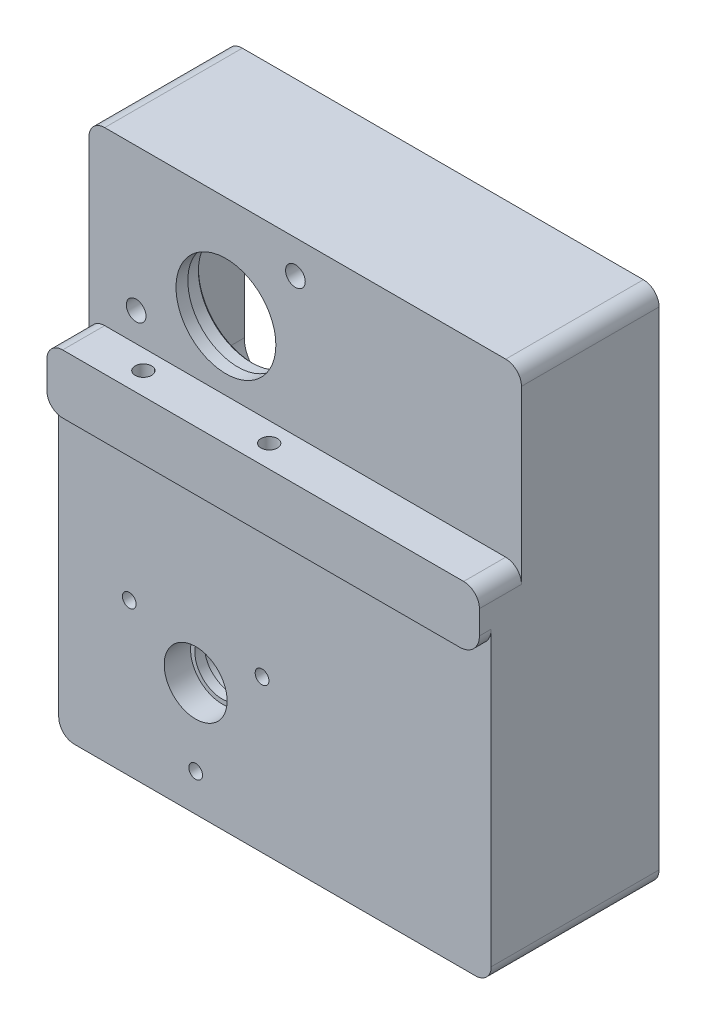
from build123d import *
from build123d.topology import SkipClean

# Parameters (mm, degrees)
ESQUISSE1_W                       = 150
ESQUISSE1_H                       = 140
BOSS_EXTRU_1_DEPTH                = 5
ESQUISSE2_R                       = 13.5
ENL_V_MAT_EXTRU_1_DEPTH           = 8
ESQUISSE12_W                      = 30
ESQUISSE12_H                      = 140
ENL_V_MAT_EXTRU_8_DEPTH           = 103.837390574
ESQUISSE3_R                       = 8
ENL_V_MAT_EXTRU_2_DEPTH           = 103.837390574
BOSS_EXTRU_2_START                = 7.7
ESQUISSE4_W                       = 120
ESQUISSE4_H                       = 96.38
ESQUISSE4_R                       = 8
BOSS_EXTRU_2_DEPTH                = 7.7
ESQUISSE6_R                       = 1.75
ENL_V_MAT_EXTRU_4_DEPTH           = 104.49791737
ESQUISSE7_W                       = 120
ESQUISSE7_H                       = 86.97
ENL_V_MAT_EXTRU_5_DEPTH           = 6.5
ENL_V_MAT_EXTRU_6_DEPTH           = 103.921226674
ENL_V_MAT_EXTRU_6_DEPTH_BACK      = 103.921226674
ESQUISSE8_R                       = 4
ESQUISSE9_R                       = 2.5
ENL_V_MAT_EXTRU_7_DEPTH           = 104.49791737
BOSS_EXTRU_3_DEPTH                = 6.5
ESQUISSE11_W                      = 120
ESQUISSE11_H                      = 140
BOSS_EXTRU_4_DEPTH                = 30
BOSS_EXTRU_9_DEPTH                = 36.5
CONG_4_R                          = 5
CONG_5_R                          = 25
ENL_V_MAT_EXTRU_10_DEPTH          = 110.008159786
ENL_V_MAT_EXTRU_10_DEPTH_BACK     = 110.008159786
ESQUISSE18_R                      = 5.5
BOSS_EXTRU_5_DEPTH                = 1
BOSS_EXTRU_5_DEPTH_BACK           = 2.7
ESQUISSE19_R                      = 5.5
ESQUISSE19_R_2                    = 4.9
ESQUISSE20_R                      = 4.9
BOSS_EXTRU_6_DEPTH                = 1
ESQUISSE21_R                      = 3
ENL_V_MAT_EXTRU_11_DEPTH          = 3
BOSS_EXTRU_7_START                = 2
ESQUISSE24_R                      = 13.5
ESQUISSE24_R_2                    = 2.5
BOSS_EXTRU_7_DEPTH                = 2
CONG_2_R                          = 4
CONG_3_R                          = 10
ESQUISSE32_R                      = 16
ESQUISSE32_R_2                    = 12.7
BOSS_EXTRU_11_DEPTH               = 3
ESQUISSE33_R                      = 9.5
ESQUISSE33_R_2                    = 8
BOSS_EXTRU_12_DEPTH               = 2.5
BOSS_EXTRU_13_DEPTH               = 0.45
BOSS_EXTRU_13_DEPTH_BACK          = 2
ESQUISSE34_R                      = 8
ESQUISSE34_R_2                    = 6.9
BOSS_EXTRU_14_DEPTH               = 6.5
BOSS_EXTRU_14_DEPTH_BACK          = 0.2
ESQUISSE35_R                      = 11
ESQUISSE35_R_2                    = 7.5
BOSS_EXTRU_15_DEPTH               = 3
TROU_TARAUD_M54_D                 = 4.2
TROU_TARAUD_M54_DEPTH             = 18
TROU_TARAUD_M54_TIP               = 1.2618073
ENL_V_START                       = -36.5
ENL_V_MAT_EXTRU_12_DEPTH          = 36.5
ENL_V_MAT_EXTRU_13_REACH          = 114.423
BOSS_EXTRU_18_DEPTH               = 35
BOSS_EXTRU_24_DEPTH               = 36.5
BOSS_EXTRU_26_START               = -42.7
BOSS_EXTRU_26_DEPTH               = 42.7
BOSS_EXTRU_28_DEPTH               = 8.5
ESQUISSE44_W                      = 4.5
ESQUISSE44_H                      = 42.7
BOSS_EXTRU_29_DEPTH               = 35
BOSS_EXTRU_30_DEPTH               = 4.5
CONG_6_R                          = 4
DIAM_TRE_DU_PER_AGE_4_0_4_1_D     = 4
DIAM_TRE_DU_PER_AGE_4_0_4_1_DEPTH = 10
DIAM_TRE_DU_PER_AGE_4_0_4_1_TIP   = 1.201721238
TROU_TARAUD_M55_D                 = 4.2
TROU_TARAUD_M55_DEPTH             = 19
TROU_TARAUD_M55_TIP               = 1.2618073
BOSS_EXTRU_31_DEPTH               = 36.5
ESQUISSE52_R                      = 1
ESQUISSE57_R                      = 8
ESQUISSE57_R_2                    = 7.5
ENL_V_MAT_EXTRU_15_DEPTH          = 0.7
CONG_7_R                          = 0.2
CONG_8_R                          = 0.1
CONG_9_R                          = 0.1
CHANFREIN1_SIZE                   = 0.5


with BuildPart() as part:
    # Esquisse1 → Boss.-Extru.1 (new body)
    with BuildSketch(Plane.XY):
        with Locations((0.17, 0)):
            Rectangle(ESQUISSE1_W, ESQUISSE1_H)
    extrude(amount=BOSS_EXTRU_1_DEPTH)

    # Esquisse2 → Enl_v. mat.-Extru.1 (cut)
    with BuildSketch(Plane.XY.offset(5)):
        with Locations((0, 43.88)):
            Circle(ESQUISSE2_R)
    extrude(amount=-ENL_V_MAT_EXTRU_1_DEPTH, mode=Mode.SUBTRACT)

    # Esquisse12 → Enl_v. mat.-Extru.8 (cut, through all)
    with BuildSketch(Plane(origin=(0, 0, 0), x_dir=(-1, 0, 0), z_dir=(0, 0, -1))):
        with Locations((59.83, 0)):
            Rectangle(ESQUISSE12_W, ESQUISSE12_H)
    extrude(amount=-ENL_V_MAT_EXTRU_8_DEPTH, mode=Mode.SUBTRACT)

    # Esquisse3 → Enl_v. mat.-Extru.2 (cut, through all)
    with BuildSketch(Plane.XY.offset(5)):
        with Locations((0, -33.03)):
            Circle(ESQUISSE3_R)
    extrude(amount=-ENL_V_MAT_EXTRU_2_DEPTH, mode=Mode.SUBTRACT)

    # Esquisse4 → Boss.-Extru.2 (add)
    with BuildSketch(Plane.XY.offset(5).offset(BOSS_EXTRU_2_START)):
        with Locations((15.17, -21.81)):
            Rectangle(ESQUISSE4_W, ESQUISSE4_H)
        with Locations((0, -33.03)):
            Circle(ESQUISSE4_R, mode=Mode.SUBTRACT)
    extrude(amount=-BOSS_EXTRU_2_DEPTH)

    # Esquisse6 → Enl_v. mat.-Extru.4 (cut, through all)
    with BuildSketch(Plane.XY.offset(12.7)):
        with Locations((16.887495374, -23.28)):
            Circle(ESQUISSE6_R)
        with Locations((-16.887495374, -23.28)):
            Circle(ESQUISSE6_R)
        with Locations((0, -52.53)):
            Circle(ESQUISSE6_R)
    extrude(amount=-ENL_V_MAT_EXTRU_4_DEPTH, mode=Mode.SUBTRACT)

    # Esquisse7 → Enl_v. mat.-Extru.5 (cut)
    with BuildSketch(Plane(origin=(0, 0, 0), x_dir=(-1, 0, 0), z_dir=(0, 0, -1))):
        with Locations((-15.17, -26.515)):
            Rectangle(ESQUISSE7_W, ESQUISSE7_H)
    extrude(amount=-ENL_V_MAT_EXTRU_5_DEPTH, mode=Mode.SUBTRACT)

    # Esquisse8 → Enl_v. mat.-Extru.6 (cut, two sides: drawn at the far end of the back side and taken through both)
    with BuildSketch(Plane(origin=(0, 0, 6.5), x_dir=(-1, 0, 0), z_dir=(0, 0, -1)).offset(-ENL_V_MAT_EXTRU_6_DEPTH_BACK)):
        with Locations(Location((-25.577138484, 9.937990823, 0), (0, 0, 180))):
            Circle(ESQUISSE8_R)
    extrude(amount=ENL_V_MAT_EXTRU_6_DEPTH + ENL_V_MAT_EXTRU_6_DEPTH_BACK, mode=Mode.SUBTRACT)

    # Esquisse9 → Enl_v. mat.-Extru.7 (cut, through all)
    with BuildSketch(Plane(origin=(0, 0, 0), x_dir=(-1, 0, 0), z_dir=(0, 0, -1))):
        with Locations((22.838636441, 33.711583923)):
            Circle(ESQUISSE9_R)
        with Locations((-17.67766953, 61.55766953)):
            Circle(ESQUISSE9_R)
    extrude(amount=-ENL_V_MAT_EXTRU_7_DEPTH, mode=Mode.SUBTRACT)

    # Esquisse10 → Boss.-Extru.3 (add)
    with BuildSketch(Plane(origin=(0, 0, 6.5), x_dir=(-1, 0, 0), z_dir=(0, 0, -1))):
        Polygon((-70.67, -65.5), (-70.67, 12.47), (-70.67, 16.97), (-75.17, 16.97), (-75.17, -70), (44.83, -70), (44.83, 16.97), (40.33, 16.97), (40.33, 12.47), (40.33, -65.5), align=None)
    extrude(amount=BOSS_EXTRU_3_DEPTH)

    # Esquisse11 → Boss.-Extru.4 (add)
    with BuildSketch(Plane(origin=(0, 0, 0), x_dir=(-1, 0, 0), z_dir=(0, 0, -1))):
        with Locations((-15.17, 0)):
            Rectangle(ESQUISSE11_W, ESQUISSE11_H)
        with BuildLine():
            Line((40.33, 65.5), (40.33, -9.5))
            ThreePointArc((40.33, -9.5), (35.83, -14), (40.33, -18.5))
            Line((40.33, -18.5), (40.33, -65.5))
            Line((40.33, -65.5), (-70.67, -65.5))
            Line((-70.67, -65.5), (-70.67, -18.5))
            ThreePointArc((-70.67, -18.5), (-66.17, -14), (-70.67, -9.5))
            Line((-70.67, -9.5), (-70.67, 65.5))
            Line((-70.67, 65.5), (40.33, 65.5))
        make_face(mode=Mode.SUBTRACT)
    extrude(amount=BOSS_EXTRU_4_DEPTH)

    # Esquisse29 → Boss.-Extru.9 (add)
    with SkipClean():  # the faces are left unmerged after this step: merging them gives an invalid solid
        with BuildSketch(Plane(origin=(0, 0, 6.5), x_dir=(-1, 0, 0), z_dir=(0, 0, -1))):
            with BuildLine():
                Line((-70.67, -9.5), (-70.67, -18.5))
                ThreePointArc((-70.67, -18.5), (-66.17, -14), (-70.67, -9.5))
            make_face()
            with BuildLine():
                Line((40.33, -9.5), (40.33, -18.5))
                ThreePointArc((40.33, -18.5), (35.83, -14), (40.33, -9.5))
            make_face()
        extrude(amount=BOSS_EXTRU_9_DEPTH)

    # Cong_4
    cong_4_edges = [part.edges().sort_by_distance(p)[0] for p in [
        (70.67, -9.5, -11.75),
        (-40.33, -18.5, -11.75),
        (-40.33, -9.5, -11.75),
        (70.67, -18.5, -11.75),
    ]]
    fillet(cong_4_edges, radius=CONG_4_R)

    # Cong_5
    cong_5_edges = [part.edges().sort_by_distance(p)[0] for p in [
        (70.67, -65.5, -11.75),
        (-40.33, -65.5, -11.75),
        (70.67, 65.5, -15),
        (-40.33, 65.5, -15),
    ]]
    fillet(cong_5_edges, radius=CONG_5_R)

    # Esquisse18 → Enl_v. mat.-Extru.10 (cut, two sides: drawn at the far end of the back side and taken through both)
    with BuildSketch(Plane(origin=(0, 0, 6.5), x_dir=(-1, 0, 0), z_dir=(0, 0, -1)).offset(-ENL_V_MAT_EXTRU_10_DEPTH_BACK)):
        with Locations(Location((-25.577138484, 9.937990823, 0), (0, 0, 180))):
            Circle(ESQUISSE18_R)
    extrude(amount=ENL_V_MAT_EXTRU_10_DEPTH + ENL_V_MAT_EXTRU_10_DEPTH_BACK, mode=Mode.SUBTRACT)

    # Esquisse19 → Boss.-Extru.5 (add, two sides: drawn at the far end of the back side and taken through both)
    with BuildSketch(Plane(origin=(0, 0, 10), x_dir=(-1, 0, 0), z_dir=(0, 0, -1)).offset(-BOSS_EXTRU_5_DEPTH_BACK)):
        with Locations((-25.577138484, 9.937990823)):
            Circle(ESQUISSE19_R)
        with Locations(Location((-25.577138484, 9.937990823, 0), (0, 0, 180))):
            Circle(ESQUISSE19_R_2, mode=Mode.SUBTRACT)
    extrude(amount=BOSS_EXTRU_5_DEPTH + BOSS_EXTRU_5_DEPTH_BACK)

    # Esquisse20 → Boss.-Extru.6 (add)
    with BuildSketch(Plane.XY.offset(12.7)):
        with Locations((25.577138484, 9.937990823)):
            Circle(ESQUISSE20_R)
    extrude(amount=-BOSS_EXTRU_6_DEPTH)

    # Esquisse21 → Enl_v. mat.-Extru.11 (cut)
    with BuildSketch(Plane(origin=(0, 0, 6.5), x_dir=(-1, 0, 0), z_dir=(0, 0, -1))):
        with Locations((-16.887495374, -23.28)):
            Circle(ESQUISSE21_R)
        with Locations((16.887495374, -23.28)):
            Circle(ESQUISSE21_R)
        with Locations((0, -52.53)):
            Circle(ESQUISSE21_R)
    extrude(amount=-ENL_V_MAT_EXTRU_11_DEPTH, mode=Mode.SUBTRACT)

    # Esquisse24 → Boss.-Extru.7 (add)
    with BuildSketch(Plane(origin=(0, 0, 0), x_dir=(-1, 0, 0), z_dir=(0, 0, -1)).offset(BOSS_EXTRU_7_START)):
        with BuildLine():
            Line((15.33, 65.5), (-45.67, 65.5))
            ThreePointArc((-45.67, 65.5), (-63.34766953, 58.17766953), (-70.67, 40.5))
            Line((-70.67, 40.5), (-70.67, 16.97))
            Line((-70.67, 16.97), (40.33, 16.97))
            Line((40.33, 16.97), (40.33, 40.5))
            ThreePointArc((40.33, 40.5), (33.00766953, 58.17766953), (15.33, 65.5))
        make_face()
        with Locations(Location((0, 43.88, 0), (0, 0, 180))):
            Circle(ESQUISSE24_R, mode=Mode.SUBTRACT)
        with Locations((-17.67766953, 61.55766953)):
            Circle(ESQUISSE24_R_2, mode=Mode.SUBTRACT)
        with Locations((22.838636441, 33.711583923)):
            Circle(ESQUISSE24_R_2, mode=Mode.SUBTRACT)
    extrude(amount=-BOSS_EXTRU_7_DEPTH)

    # Cong_2
    cong_2_edges = [part.edges().sort_by_distance(p)[0] for p in [
        (-44.83, -70, -8.65),
        (-44.83, 70, -12.5),
        (75.17, 26.38, 8.85),
        (-44.83, 26.38, 8.85),
        (75.17, 70, -12.5),
        (75.17, -70, -8.65),
    ]]
    fillet(cong_2_edges, radius=CONG_2_R)

    # Cong_3
    cong_3_edges = [part.edges().sort_by_distance(p)[0] for p in [
        (70.67, 16.97, 2.25),
        (-40.33, 16.97, 2.25),
    ]]
    fillet(cong_3_edges, radius=CONG_3_R)

    # Esquisse32 → Boss.-Extru.11 (add)
    with BuildSketch(Plane.XY.offset(5)):
        with Locations((0, 43.88)):
            Circle(ESQUISSE32_R)
        with Locations((0, 43.88)):
            Circle(ESQUISSE32_R_2, mode=Mode.SUBTRACT)
    extrude(amount=-BOSS_EXTRU_11_DEPTH)

    # Esquisse33 → Boss.-Extru.12 (add)
    with BuildSketch(Plane(origin=(0, 0, 6.5), x_dir=(-1, 0, 0), z_dir=(0, 0, -1))):
        with Locations(Location((0, -33.03, 0), (0, 0, 180))):
            Circle(ESQUISSE33_R)
        with Locations(Location((0, -33.03, 0), (0, 0, 180))):
            Circle(ESQUISSE33_R_2, mode=Mode.SUBTRACT)
    extrude(amount=BOSS_EXTRU_12_DEPTH)

    # Esquisse34 → Boss.-Extru.13 (add, two sides: drawn at the far end of the back side and taken through both)
    with BuildSketch(Plane(origin=(0, 0, 4), x_dir=(-1, 0, 0), z_dir=(0, 0, -1)).offset(-BOSS_EXTRU_13_DEPTH_BACK)):
        with Locations(Location((0, -33.03, 0), (0, 0, 180))):
            Circle(ESQUISSE34_R)
        with Locations((0, -33.03)):
            Circle(ESQUISSE34_R_2, mode=Mode.SUBTRACT)
    extrude(amount=BOSS_EXTRU_13_DEPTH + BOSS_EXTRU_13_DEPTH_BACK)

    # Esquisse35 → Boss.-Extru.14 (add, two sides: drawn at the far end of the back side and taken through both)
    with BuildSketch(Plane(origin=(0, 0, 6.5), x_dir=(-1, 0, 0), z_dir=(0, 0, -1)).offset(-BOSS_EXTRU_14_DEPTH_BACK)):
        with Locations((0, -33.03)):
            Circle(ESQUISSE35_R)
        with Locations((0, -33.03)):
            Circle(ESQUISSE35_R_2, mode=Mode.SUBTRACT)
    extrude(amount=BOSS_EXTRU_14_DEPTH + BOSS_EXTRU_14_DEPTH_BACK)

    # Esquisse30 → Boss.-Extru.15 (add)
    with BuildSketch(Plane.XY.offset(12.7)):
        with BuildLine():
            ThreePointArc((-44.83, 16.38), (-43.365533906, 12.844466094), (-39.83, 11.38))
            Line((-39.83, 11.38), (70.17, 11.38))
            ThreePointArc((70.17, 11.38), (73.705533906, 12.844466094), (75.17, 16.38))
            Line((75.17, 16.38), (75.17, 22.38))
            ThreePointArc((75.17, 22.38), (73.998427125, 25.208427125), (71.17, 26.38))
            Line((71.17, 26.38), (15.312565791, 26.38))
            Line((15.312565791, 26.38), (-40.83, 26.38))
            ThreePointArc((-40.83, 26.38), (-43.658427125, 25.208427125), (-44.83, 22.38))
            Line((-44.83, 22.38), (-44.83, 16.38))
        make_face()
    extrude(amount=BOSS_EXTRU_15_DEPTH)

    # Trou taraud_ M54
    with Locations(Plane(origin=(0, 26.38, 0), x_dir=(1, 0, 0), z_dir=(0, 1, 0))):
        with Locations((16, -10), (-16, -10)):
            Hole(TROU_TARAUD_M54_D / 2, depth=TROU_TARAUD_M54_DEPTH)
            with Locations((0, 0, -(TROU_TARAUD_M54_DEPTH + TROU_TARAUD_M54_TIP / 2))):  # 118° drill point
                Cone(0, TROU_TARAUD_M54_D / 2, TROU_TARAUD_M54_TIP, mode=Mode.SUBTRACT)

    # Esquisse37 → Enl_v. mat.-Extru.12 (cut)
    with BuildSketch(Plane(origin=(0, 0, -30), x_dir=(-1, 0, 0), z_dir=(0, 0, -1)).offset(ENL_V_START)):
        with BuildLine():
            Line((-70.67, -5.922252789), (-70.67, -22.077747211))
            ThreePointArc((-70.67, -22.077747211), (-70.03794544, -19.644425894), (-68.301578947, -17.82630131))
            ThreePointArc((-68.301578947, -17.82630131), (-66.17, -14), (-68.301578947, -10.17369869))
            ThreePointArc((-68.301578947, -10.17369869), (-70.03794544, -8.355574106), (-70.67, -5.922252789))
        make_face()
        with BuildLine():
            Line((40.33, -22.077747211), (40.33, -5.922252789))
            ThreePointArc((40.33, -5.922252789), (39.69794544, -8.355574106), (37.961578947, -10.17369869))
            ThreePointArc((37.961578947, -10.17369869), (35.83, -14), (37.961578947, -17.82630131))
            ThreePointArc((37.961578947, -17.82630131), (39.69794544, -19.644425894), (40.33, -22.077747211))
        make_face()
    extrude(amount=ENL_V_MAT_EXTRU_12_DEPTH, mode=Mode.SUBTRACT)

    # Enl_v. mat.-Extru.13: up to this face of the body (flat: up to its plane)
    enl_v_mat_extru_13_end = Plane(part.part.faces().sort_by_distance((15.17, 18.892973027, 15.7))[0])
    # Esquisse38 → Enl_v. mat.-Extru.13 (cut, up to the picked face)
    with BuildSketch(Plane(origin=(0, 0, -30), x_dir=(-1, 0, 0), z_dir=(0, 0, -1)), mode=Mode.PRIVATE) as enl_v_mat_extru_13_sk1:
        with BuildLine():
            Line((-70.67, -32.5), (-75.17, -32.5))
            Line((-75.17, -32.5), (-75.17, -70))
            Line((-75.17, -70), (45, -70))
            Line((45, -70), (45, 70))
            Line((45, 70), (5.33, 70))
            Line((5.33, 70), (5.33, 65.5))
            ThreePointArc((5.33, 65.5), (23.00766953, 58.17766953), (30.33, 40.5))
            Line((30.33, 40.5), (30.33, -32.5))
            ThreePointArc((30.33, -32.5), (23.00766953, -50.17766953), (5.33, -57.5))
            Line((5.33, -57.5), (-45.67, -57.5))
            ThreePointArc((-45.67, -57.5), (-63.34766953, -50.17766953), (-70.67, -32.5))
        make_face()
    enl_v_mat_extru_13_tool1 = split(extrude(enl_v_mat_extru_13_sk1.sketch, amount=-ENL_V_MAT_EXTRU_13_REACH, mode=Mode.PRIVATE), bisect_by=enl_v_mat_extru_13_end, keep=Keep.BOTH, mode=Mode.PRIVATE)
    add(enl_v_mat_extru_13_tool1.solids().sort_by(Axis((72.92, -34.345016, -30), (0, 0, 1)))[0], mode=Mode.SUBTRACT)

    # Esquisse39 → Boss.-Extru.18 (add)
    with BuildSketch(Plane(origin=(0, 0, -30), x_dir=(-1, 0, 0), z_dir=(0, 0, -1))):
        with BuildLine():
            Line((30.33, 40.5), (30.33, 16.97))
            Line((30.33, 16.97), (34.83, 16.97))
            Line((34.83, 16.97), (34.83, 66))
            ThreePointArc((34.83, 66), (33.658427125, 68.828427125), (30.83, 70))
            Line((30.83, 70), (5.33, 70))
            Line((5.33, 70), (5.33, 65.5))
            ThreePointArc((5.33, 65.5), (23.00766953, 58.17766953), (30.33, 40.5))
        make_face()
    extrude(amount=-BOSS_EXTRU_18_DEPTH)

    # Esquisse40 → Boss.-Extru.24 (add)
    with BuildSketch(Plane(origin=(0, 0, -30), x_dir=(-1, 0, 0), z_dir=(0, 0, -1))):
        with BuildLine():
            Line((-70.67, -14.192245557), (-70.67, 1.973251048))
            ThreePointArc((-70.67, 1.973251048), (-70.03760845, -0.460675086), (-68.300401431, -2.278923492))
            ThreePointArc((-68.300401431, -2.278923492), (-66.165747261, -6.109497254), (-68.300401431, -9.940071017))
            ThreePointArc((-68.300401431, -9.940071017), (-70.03760845, -11.758319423), (-70.67, -14.192245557))
        make_face()
        with BuildLine():
            Line((30.33, -14.192245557), (30.33, 1.973251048))
            ThreePointArc((30.33, 1.973251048), (29.69760845, -0.460675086), (27.960401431, -2.278923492))
            ThreePointArc((27.960401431, -2.278923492), (25.825747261, -6.109497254), (27.960401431, -9.940071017))
            ThreePointArc((27.960401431, -9.940071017), (29.69760845, -11.758319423), (30.33, -14.192245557))
        make_face()
    extrude(amount=-BOSS_EXTRU_24_DEPTH)

    # Esquisse41 → Boss.-Extru.26 (add)
    with BuildSketch(Plane.XY.offset(12.7).offset(BOSS_EXTRU_26_START)):
        with BuildLine():
            Line((70.67, -32.5), (75.17, -32.5))
            Line((75.17, -32.5), (75.17, -58))
            ThreePointArc((75.17, -58), (73.998427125, -60.828427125), (71.17, -62))
            Line((71.17, -62), (-30.83, -62))
            ThreePointArc((-30.83, -62), (-33.658427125, -60.828427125), (-34.83, -58))
            Line((-34.83, -58), (-34.83, 1.973251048))
            Line((-34.83, 1.973251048), (-30.33, 1.973251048))
            Line((-30.33, 1.973251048), (-30.33, -32.5))
            ThreePointArc((-30.33, -32.5), (-23.00766953, -50.17766953), (-5.33, -57.5))
            Line((-5.33, -57.5), (45.67, -57.5))
            ThreePointArc((45.67, -57.5), (63.34766953, -50.17766953), (70.67, -32.5))
        make_face()
    extrude(amount=BOSS_EXTRU_26_DEPTH)

    # Esquisse43 → Boss.-Extru.28 (add)
    with BuildSketch(Plane(origin=(0, 0, 6.5), x_dir=(-1, 0, 0), z_dir=(0, 0, -1))):
        with BuildLine():
            Line((30.33, 6.97), (30.33, 16.97))
            Line((30.33, 16.97), (20.33, 16.97))
            ThreePointArc((20.33, 16.97), (27.401067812, 14.041067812), (30.33, 6.97))
        make_face()
    extrude(amount=BOSS_EXTRU_28_DEPTH)

    # Esquisse44 → Boss.-Extru.29 (add)
    with BuildSketch(Plane.XZ.offset(-16.97)):
        with Locations((-32.58, -8.65)):
            Rectangle(ESQUISSE44_W, ESQUISSE44_H)
    extrude(amount=BOSS_EXTRU_29_DEPTH)

    # Esquisse46 → Boss.-Extru.30 (add)
    with BuildSketch(Plane.ZY.offset(30.33)):
        Polygon((15.7, 11.38), (12.7, 11.38), (12.7, 16.97), (5, 16.97), (5, 26.38), (12.7, 26.38), (15.7, 26.38), align=None)
    extrude(amount=BOSS_EXTRU_30_DEPTH)

    # Cong_6
    cong_6_edges = [part.edges().sort_by_distance(p)[0] for p in [
        (-34.83, 11.38, 14.2),
        (-34.83, 26.38, 10.35),
    ]]
    fillet(cong_6_edges, radius=CONG_6_R)

    # Diam_tre du per_age _4.0 _4_1
    with Locations(Plane(origin=(0, 0, -30), x_dir=(-1, 0, 0), z_dir=(0, 0, -1))):
        with Locations((-70.67, 59.5), (30.275634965, -51.450343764)):
            Hole(DIAM_TRE_DU_PER_AGE_4_0_4_1_D / 2, depth=DIAM_TRE_DU_PER_AGE_4_0_4_1_DEPTH)
            with Locations((0, 0, -(DIAM_TRE_DU_PER_AGE_4_0_4_1_DEPTH + DIAM_TRE_DU_PER_AGE_4_0_4_1_TIP / 2))):  # 118° drill point
                Cone(0, DIAM_TRE_DU_PER_AGE_4_0_4_1_D / 2, DIAM_TRE_DU_PER_AGE_4_0_4_1_TIP, mode=Mode.SUBTRACT)

    # Trou taraud_ M55
    with Locations(Plane(origin=(0, 0, -30), x_dir=(-1, 0, 0), z_dir=(0, 0, -1))):
        with Locations((-70.679649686, 65.401108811), (30.320350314, 65.401108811), (30.320350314, -57.598891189), (-70.679649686, -57.598891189), (-70.679649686, -6.098891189), (30.320350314, -6.098891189)):
            Hole(TROU_TARAUD_M55_D / 2, depth=TROU_TARAUD_M55_DEPTH)
            with Locations((0, 0, -(TROU_TARAUD_M55_DEPTH + TROU_TARAUD_M55_TIP / 2))):  # 118° drill point
                Cone(0, TROU_TARAUD_M55_D / 2, TROU_TARAUD_M55_TIP, mode=Mode.SUBTRACT)

    # Esquisse50 → Boss.-Extru.31 (add)
    with BuildSketch(Plane(origin=(0, 0, -30), x_dir=(-1, 0, 0), z_dir=(0, 0, -1))):
        with BuildLine():
            Line((-70.67, 6.440403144), (-70.67, 1.968249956))
            ThreePointArc((-70.67, 1.968249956), (-70.03794544, -0.465071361), (-68.301578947, -2.283195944))
            ThreePointArc((-68.301578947, -2.283195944), (-66.17, -6.109497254), (-68.301578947, -9.935798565))
            ThreePointArc((-68.301578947, -9.935798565), (-70.03794544, -11.753923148), (-70.67, -14.187244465))
            Line((-70.67, -14.187244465), (-70.67, -18.659397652))
            ThreePointArc((-70.67, -18.659397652), (-69.688336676, -14.884199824), (-66.992033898, -12.065382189))
            ThreePointArc((-66.992033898, -12.065382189), (-63.67, -6.109497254), (-66.992033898, -0.15361232))
            ThreePointArc((-66.992033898, -0.15361232), (-69.688336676, 2.665205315), (-70.67, 6.440403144))
        make_face()
        with BuildLine():
            Line((30.33, -18.659397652), (30.33, -14.187244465))
            ThreePointArc((30.33, -14.187244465), (29.69794544, -11.753923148), (27.961578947, -9.935798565))
            ThreePointArc((27.961578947, -9.935798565), (25.83, -6.109497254), (27.961578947, -2.283195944))
            ThreePointArc((27.961578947, -2.283195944), (29.69794544, -0.465071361), (30.33, 1.968249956))
            Line((30.33, 1.968249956), (30.33, 6.440403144))
            ThreePointArc((30.33, 6.440403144), (29.348336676, 2.665205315), (26.652033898, -0.15361232))
            ThreePointArc((26.652033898, -0.15361232), (23.33, -6.109497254), (26.652033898, -12.065382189))
            ThreePointArc((26.652033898, -12.065382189), (29.348336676, -14.884199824), (30.33, -18.659397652))
        make_face()
    extrude(amount=-BOSS_EXTRU_31_DEPTH)

    # Enl_vement de mati_re-Balayage1: sweep along a path in Esquisse51
    with BuildLine(Plane(origin=(0, 0, -30), x_dir=(-1, 0, 0), z_dir=(0, 0, -1))) as enl_vement_de_mati_re_balayage1_path:
        Line((32.58, 6.440403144), (32.58, 40.5))
        ThreePointArc((32.58, 40.5), (24.598659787, 59.768659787), (5.33, 67.75))
        Line((5.33, 67.75), (-45.67, 67.75))
        ThreePointArc((-45.67, 67.75), (-64.938659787, 59.768659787), (-72.92, 40.5))
        Line((-72.92, 40.5), (-72.92, 6.440403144))
        ThreePointArc((-72.92, 6.440403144), (-71.653337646, 1.569180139), (-68.174237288, -2.068003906))
        ThreePointArc((-68.174237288, -2.068003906), (-65.92, -6.109497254), (-68.174237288, -10.150990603))
        ThreePointArc((-68.174237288, -10.150990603), (-71.653337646, -13.788174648), (-72.92, -18.659397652))
        Line((-72.92, -18.659397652), (-72.92, -32.5))
        ThreePointArc((-72.92, -32.5), (-64.938659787, -51.768659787), (-45.67, -59.75))
        Line((-45.67, -59.75), (5.33, -59.75))
        ThreePointArc((5.33, -59.75), (24.598659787, -51.768659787), (32.58, -32.5))
        Line((32.58, -32.5), (32.58, -18.659397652))
        ThreePointArc((32.58, -18.659397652), (31.313337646, -13.788174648), (27.834237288, -10.150990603))
        ThreePointArc((27.834237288, -10.150990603), (25.58, -6.109497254), (27.834237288, -2.068003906))
        ThreePointArc((27.834237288, -2.068003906), (31.313337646, 1.569180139), (32.58, 6.440403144))
    # Esquisse52 → Enl_vement de mati_re-Balayage1 (sweep, cut)
    with BuildSketch(Plane(origin=(0, -22, 0), x_dir=(-1, 0, 0), z_dir=(0, -1, 0))):
        with Locations((-72.92, 30)):
            Circle(ESQUISSE52_R)
    sweep(path=enl_vement_de_mati_re_balayage1_path.line, mode=Mode.SUBTRACT)

    # Esquisse57 → Enl_v. mat.-Extru.15 (cut)
    with BuildSketch(Plane.XY.offset(6.7)):
        with Locations((0, -33.03)):
            Circle(ESQUISSE57_R)
        with Locations(Location((0, -33.03, 0), (0, 0, 180))):
            Circle(ESQUISSE57_R_2, mode=Mode.SUBTRACT)
    extrude(amount=-ENL_V_MAT_EXTRU_15_DEPTH, mode=Mode.SUBTRACT)

    # Cong_7
    cong_7_edges = [part.edges().sort_by_distance(p)[0] for p in [
        (-13.5, 43.88, 2),
    ]]
    fillet(cong_7_edges, radius=CONG_7_R)

    # Cong_8
    cong_8_edges = [part.edges().sort_by_distance(p)[0] for p in [
        (20.077138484, 9.937990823, 9),
    ]]
    fillet(cong_8_edges, radius=CONG_8_R)

    # Cong_9
    cong_9_edges = [part.edges().sort_by_distance(p)[0] for p in [
        (7.5, -33.03, 3.55),
    ]]
    fillet(cong_9_edges, radius=CONG_9_R)

    # Chanfrein1
    chanfrein1_edges = [part.edges().sort_by_distance(p)[0] for p in [
        (20.077138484, 9.937990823, 6.5),
        (-13.5, 43.88, -2),
        (7.5, -33.03, 0),
    ]]
    chamfer(chanfrein1_edges, length=CHANFREIN1_SIZE)


solid = part.part
